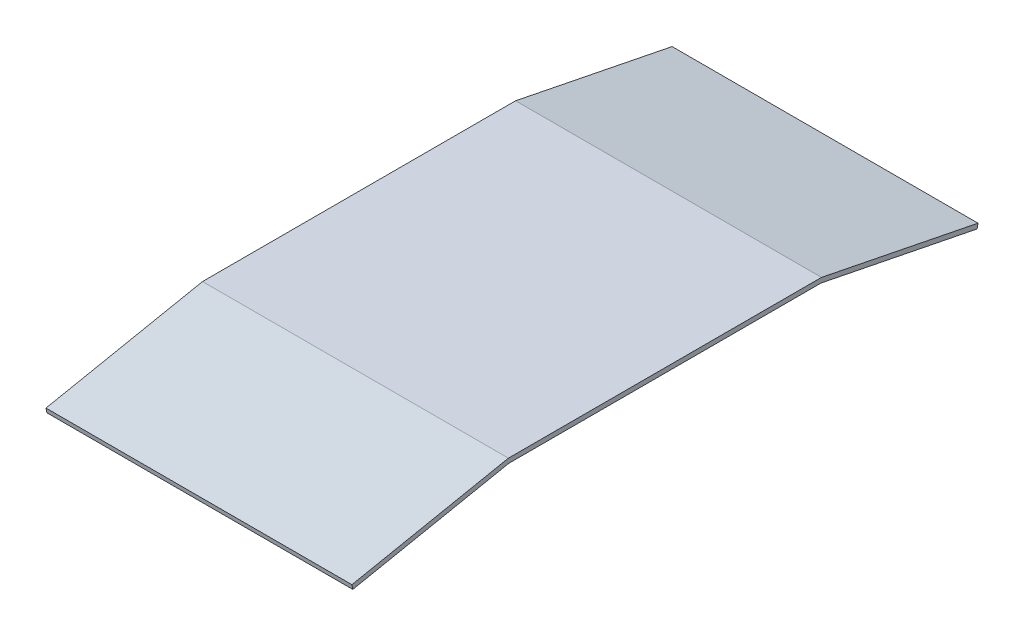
from build123d import *

# Parameters (mm, degrees)
BOSS_EXTRU_1_DEPTH = 196


with BuildPart() as part:
    # Esquisse1 → Boss.-Extru.1 (new body)
    with BuildSketch(Plane(origin=(0, 0, 0), x_dir=(0, 0, -1), z_dir=(1, 0, 0))):
        Polygon((100, 20), (200, 0), (200.588348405, 2.941742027), (100.297058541, 23), (-100.297058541, 23), (-200.588348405, 2.941742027), (-200, 0), (-100, 20), align=None)
    extrude(amount=BOSS_EXTRU_1_DEPTH)


solid = part.part
